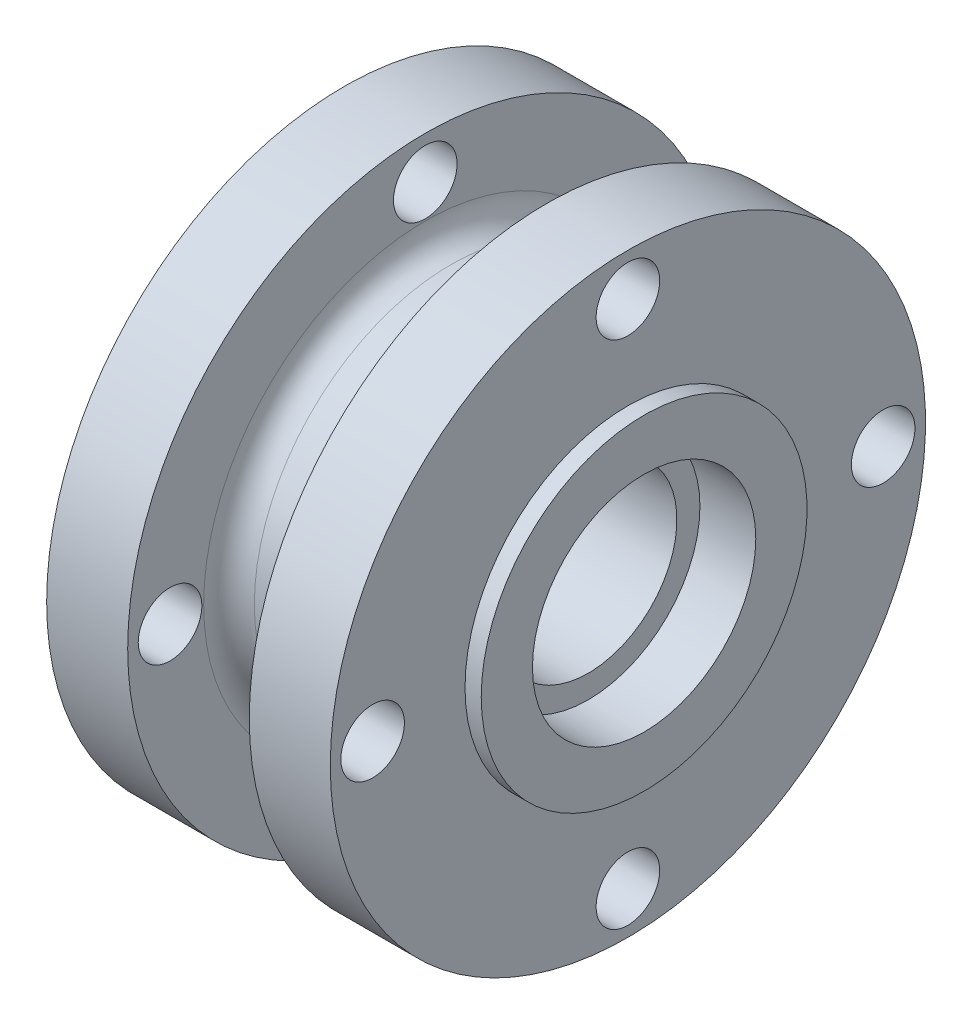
ISO-10303-21;
HEADER;
FILE_DESCRIPTION(('STEP AP214'),'2;1');
FILE_NAME('part.step','',(''),(''),'','','');
FILE_SCHEMA(('AUTOMOTIVE_DESIGN { 1 0 10303 214 1 1 1 1 }'));
ENDSEC;
DATA;
#1=APPLICATION_CONTEXT('core data for automotive mechanical design processes');
#2=APPLICATION_PROTOCOL_DEFINITION('international standard','automotive_design',2000,#1);
#3=PRODUCT_CONTEXT('',#1,'mechanical');
#4=PRODUCT('Part','Part','',(#3));
#5=PRODUCT_RELATED_PRODUCT_CATEGORY('part','',(#4));
#6=PRODUCT_DEFINITION_FORMATION('','',#4);
#7=PRODUCT_DEFINITION_CONTEXT('part definition',#1,'design');
#8=PRODUCT_DEFINITION('design','',#6,#7);
#9=PRODUCT_DEFINITION_SHAPE('','',#8);
#10=(LENGTH_UNIT() NAMED_UNIT(*) SI_UNIT(.MILLI.,.METRE.));
#11=(NAMED_UNIT(*) PLANE_ANGLE_UNIT() SI_UNIT($,.RADIAN.));
#12=(NAMED_UNIT(*) SI_UNIT($,.STERADIAN.) SOLID_ANGLE_UNIT());
#13=UNCERTAINTY_MEASURE_WITH_UNIT(LENGTH_MEASURE(1.E-05),#10,'distance_accuracy_value','');
#14=(GEOMETRIC_REPRESENTATION_CONTEXT(3) GLOBAL_UNCERTAINTY_ASSIGNED_CONTEXT((#13)) GLOBAL_UNIT_ASSIGNED_CONTEXT((#10,
#11,#12)) REPRESENTATION_CONTEXT('',''));
#15=CARTESIAN_POINT('',(0.,0.,0.));
#16=DIRECTION('',(0.,0.,1.));
#17=DIRECTION('',(1.,0.,0.));
#18=AXIS2_PLACEMENT_3D('',#15,#16,#17);
#19=CARTESIAN_POINT('',(12.192,24.6126,0.));
#20=DIRECTION('',(-1.,0.,0.));
#21=DIRECTION('',(0.,0.,1.));
#22=AXIS2_PLACEMENT_3D('',#19,#20,#21);
#23=PLANE('',#22);
#24=CARTESIAN_POINT('',(12.192,0.,0.));
#25=DIRECTION('',(-1.,0.,0.));
#26=DIRECTION('',(0.,0.,1.));
#27=AXIS2_PLACEMENT_3D('',#24,#25,#26);
#28=CIRCLE('',#27,27.7876);
#29=CARTESIAN_POINT('',(12.192,0.,27.7876));
#30=VERTEX_POINT('',#29);
#31=EDGE_CURVE('E10',#30,#30,#28,.T.);
#32=ORIENTED_EDGE('',*,*,#31,.T.);
#33=EDGE_LOOP('',(#32));
#34=FACE_BOUND('',#33,.T.);
#35=CARTESIAN_POINT('',(12.192,0.,32.004));
#36=DIRECTION('',(-1.,0.,0.));
#37=DIRECTION('',(0.,0.,1.));
#38=AXIS2_PLACEMENT_3D('',#35,#36,#37);
#39=CIRCLE('',#38,3.9878);
#40=CARTESIAN_POINT('',(12.192,0.,35.9918));
#41=VERTEX_POINT('',#40);
#42=EDGE_CURVE('E61',#41,#41,#39,.F.);
#43=ORIENTED_EDGE('',*,*,#42,.F.);
#44=EDGE_LOOP('',(#43));
#45=FACE_BOUND('',#44,.T.);
#46=CARTESIAN_POINT('',(12.192,-32.004,0.));
#47=DIRECTION('',(-1.,0.,0.));
#48=DIRECTION('',(0.,0.,1.));
#49=AXIS2_PLACEMENT_3D('',#46,#47,#48);
#50=CIRCLE('',#49,3.9878);
#51=CARTESIAN_POINT('',(12.192,-32.004,3.9878));
#52=VERTEX_POINT('',#51);
#53=EDGE_CURVE('E69',#52,#52,#50,.F.);
#54=ORIENTED_EDGE('',*,*,#53,.F.);
#55=EDGE_LOOP('',(#54));
#56=FACE_BOUND('',#55,.T.);
#57=CARTESIAN_POINT('',(12.192,0.,0.));
#58=DIRECTION('',(-1.,0.,0.));
#59=DIRECTION('',(0.,0.,1.));
#60=AXIS2_PLACEMENT_3D('',#57,#58,#59);
#61=CIRCLE('',#60,37.3126);
#62=CARTESIAN_POINT('',(12.192,0.,37.3126));
#63=VERTEX_POINT('',#62);
#64=EDGE_CURVE('E109',#63,#63,#61,.T.);
#65=ORIENTED_EDGE('',*,*,#64,.F.);
#66=EDGE_LOOP('',(#65));
#67=FACE_BOUND('',#66,.T.);
#68=CARTESIAN_POINT('',(12.192,32.004,0.));
#69=DIRECTION('',(-1.,0.,0.));
#70=DIRECTION('',(0.,0.,1.));
#71=AXIS2_PLACEMENT_3D('',#68,#69,#70);
#72=CIRCLE('',#71,3.9878);
#73=CARTESIAN_POINT('',(12.192,32.004,3.9878));
#74=VERTEX_POINT('',#73);
#75=EDGE_CURVE('E65',#74,#74,#72,.F.);
#76=ORIENTED_EDGE('',*,*,#75,.F.);
#77=EDGE_LOOP('',(#76));
#78=FACE_BOUND('',#77,.T.);
#79=CARTESIAN_POINT('',(12.192,0.,-32.004));
#80=DIRECTION('',(-1.,0.,0.));
#81=DIRECTION('',(0.,0.,1.));
#82=AXIS2_PLACEMENT_3D('',#79,#80,#81);
#83=CIRCLE('',#82,3.9878);
#84=CARTESIAN_POINT('',(12.192,0.,-28.0162));
#85=VERTEX_POINT('',#84);
#86=EDGE_CURVE('E57',#85,#85,#83,.F.);
#87=ORIENTED_EDGE('',*,*,#86,.F.);
#88=EDGE_LOOP('',(#87));
#89=FACE_BOUND('',#88,.T.);
#90=ADVANCED_FACE('F33',(#34,#45,#56,#67,#78,#89),#23,.F.);
#91=CARTESIAN_POINT('',(2.03199999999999,37.3126,0.));
#92=DIRECTION('',(1.,0.,0.));
#93=DIRECTION('',(0.,0.,-1.));
#94=AXIS2_PLACEMENT_3D('',#91,#92,#93);
#95=PLANE('',#94);
#96=CARTESIAN_POINT('',(2.032,0.,32.004));
#97=DIRECTION('',(1.,0.,0.));
#98=DIRECTION('',(0.,0.,-1.));
#99=AXIS2_PLACEMENT_3D('',#96,#97,#98);
#100=CIRCLE('',#99,3.9878);
#101=CARTESIAN_POINT('',(2.032,0.,28.0162));
#102=VERTEX_POINT('',#101);
#103=EDGE_CURVE('E58',#102,#102,#100,.F.);
#104=ORIENTED_EDGE('',*,*,#103,.F.);
#105=EDGE_LOOP('',(#104));
#106=FACE_BOUND('',#105,.T.);
#107=CARTESIAN_POINT('',(2.032,-32.004,0.));
#108=DIRECTION('',(1.,0.,0.));
#109=DIRECTION('',(0.,0.,-1.));
#110=AXIS2_PLACEMENT_3D('',#107,#108,#109);
#111=CIRCLE('',#110,3.9878);
#112=CARTESIAN_POINT('',(2.032,-32.004,-3.9878));
#113=VERTEX_POINT('',#112);
#114=EDGE_CURVE('E66',#113,#113,#111,.F.);
#115=ORIENTED_EDGE('',*,*,#114,.F.);
#116=EDGE_LOOP('',(#115));
#117=FACE_BOUND('',#116,.T.);
#118=CARTESIAN_POINT('',(2.03199999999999,0.,0.));
#119=DIRECTION('',(-1.,0.,0.));
#120=DIRECTION('',(0.,0.,1.));
#121=AXIS2_PLACEMENT_3D('',#118,#119,#120);
#122=CIRCLE('',#121,20.4216);
#123=CARTESIAN_POINT('',(2.03199999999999,0.,20.4216));
#124=VERTEX_POINT('',#123);
#125=EDGE_CURVE('E115',#124,#124,#122,.T.);
#126=ORIENTED_EDGE('',*,*,#125,.F.);
#127=EDGE_LOOP('',(#126));
#128=FACE_BOUND('',#127,.T.);
#129=CARTESIAN_POINT('',(2.03199999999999,0.,0.));
#130=DIRECTION('',(-1.,0.,0.));
#131=DIRECTION('',(0.,0.,1.));
#132=AXIS2_PLACEMENT_3D('',#129,#130,#131);
#133=CIRCLE('',#132,37.3126);
#134=CARTESIAN_POINT('',(2.03199999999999,0.,37.3126));
#135=VERTEX_POINT('',#134);
#136=EDGE_CURVE('E112',#135,#135,#133,.T.);
#137=ORIENTED_EDGE('',*,*,#136,.T.);
#138=EDGE_LOOP('',(#137));
#139=FACE_BOUND('',#138,.T.);
#140=CARTESIAN_POINT('',(2.032,32.004,0.));
#141=DIRECTION('',(1.,0.,0.));
#142=DIRECTION('',(0.,0.,-1.));
#143=AXIS2_PLACEMENT_3D('',#140,#141,#142);
#144=CIRCLE('',#143,3.9878);
#145=CARTESIAN_POINT('',(2.032,32.004,-3.9878));
#146=VERTEX_POINT('',#145);
#147=EDGE_CURVE('E62',#146,#146,#144,.F.);
#148=ORIENTED_EDGE('',*,*,#147,.F.);
#149=EDGE_LOOP('',(#148));
#150=FACE_BOUND('',#149,.T.);
#151=CARTESIAN_POINT('',(2.032,0.,-32.004));
#152=DIRECTION('',(1.,0.,0.));
#153=DIRECTION('',(0.,0.,-1.));
#154=AXIS2_PLACEMENT_3D('',#151,#152,#153);
#155=CIRCLE('',#154,3.9878);
#156=CARTESIAN_POINT('',(2.032,0.,-35.9918));
#157=VERTEX_POINT('',#156);
#158=EDGE_CURVE('E54',#157,#157,#155,.F.);
#159=ORIENTED_EDGE('',*,*,#158,.F.);
#160=EDGE_LOOP('',(#159));
#161=FACE_BOUND('',#160,.T.);
#162=ADVANCED_FACE('F147',(#106,#117,#128,#139,#150,#161),#95,.F.);
#163=CARTESIAN_POINT('',(37.592,20.4216,0.));
#164=DIRECTION('',(-1.,0.,0.));
#165=DIRECTION('',(0.,0.,1.));
#166=AXIS2_PLACEMENT_3D('',#163,#164,#165);
#167=PLANE('',#166);
#168=CARTESIAN_POINT('',(37.592,0.,32.004));
#169=DIRECTION('',(-1.,0.,0.));
#170=DIRECTION('',(0.,0.,1.));
#171=AXIS2_PLACEMENT_3D('',#168,#169,#170);
#172=CIRCLE('',#171,3.9878);
#173=CARTESIAN_POINT('',(37.592,0.,35.9918));
#174=VERTEX_POINT('',#173);
#175=EDGE_CURVE('E77',#174,#174,#172,.F.);
#176=ORIENTED_EDGE('',*,*,#175,.F.);
#177=EDGE_LOOP('',(#176));
#178=FACE_BOUND('',#177,.T.);
#179=CARTESIAN_POINT('',(37.592,32.004,0.));
#180=DIRECTION('',(-1.,0.,0.));
#181=DIRECTION('',(0.,0.,1.));
#182=AXIS2_PLACEMENT_3D('',#179,#180,#181);
#183=CIRCLE('',#182,3.9878);
#184=CARTESIAN_POINT('',(37.592,32.004,3.9878));
#185=VERTEX_POINT('',#184);
#186=EDGE_CURVE('E85',#185,#185,#183,.F.);
#187=ORIENTED_EDGE('',*,*,#186,.F.);
#188=EDGE_LOOP('',(#187));
#189=FACE_BOUND('',#188,.T.);
#190=CARTESIAN_POINT('',(37.592,0.,0.));
#191=DIRECTION('',(-1.,0.,0.));
#192=DIRECTION('',(0.,0.,1.));
#193=AXIS2_PLACEMENT_3D('',#190,#191,#192);
#194=CIRCLE('',#193,37.3126);
#195=CARTESIAN_POINT('',(37.592,0.,37.3126));
#196=VERTEX_POINT('',#195);
#197=EDGE_CURVE('E103',#196,#196,#194,.T.);
#198=ORIENTED_EDGE('',*,*,#197,.F.);
#199=EDGE_LOOP('',(#198));
#200=FACE_BOUND('',#199,.T.);
#201=CARTESIAN_POINT('',(37.592,0.,0.));
#202=DIRECTION('',(-1.,0.,0.));
#203=DIRECTION('',(0.,0.,1.));
#204=AXIS2_PLACEMENT_3D('',#201,#202,#203);
#205=CIRCLE('',#204,20.4216);
#206=CARTESIAN_POINT('',(37.592,0.,20.4216));
#207=VERTEX_POINT('',#206);
#208=EDGE_CURVE('E100',#207,#207,#205,.T.);
#209=ORIENTED_EDGE('',*,*,#208,.T.);
#210=EDGE_LOOP('',(#209));
#211=FACE_BOUND('',#210,.T.);
#212=CARTESIAN_POINT('',(37.592,0.,-32.004));
#213=DIRECTION('',(-1.,0.,0.));
#214=DIRECTION('',(0.,0.,1.));
#215=AXIS2_PLACEMENT_3D('',#212,#213,#214);
#216=CIRCLE('',#215,3.9878);
#217=CARTESIAN_POINT('',(37.592,0.,-28.0162));
#218=VERTEX_POINT('',#217);
#219=EDGE_CURVE('E81',#218,#218,#216,.F.);
#220=ORIENTED_EDGE('',*,*,#219,.F.);
#221=EDGE_LOOP('',(#220));
#222=FACE_BOUND('',#221,.T.);
#223=CARTESIAN_POINT('',(37.592,-32.004,0.));
#224=DIRECTION('',(-1.,0.,0.));
#225=DIRECTION('',(0.,0.,1.));
#226=AXIS2_PLACEMENT_3D('',#223,#224,#225);
#227=CIRCLE('',#226,3.9878);
#228=CARTESIAN_POINT('',(37.592,-32.004,3.9878));
#229=VERTEX_POINT('',#228);
#230=EDGE_CURVE('E73',#229,#229,#227,.F.);
#231=ORIENTED_EDGE('',*,*,#230,.F.);
#232=EDGE_LOOP('',(#231));
#233=FACE_BOUND('',#232,.T.);
#234=ADVANCED_FACE('F152',(#178,#189,#200,#211,#222,#233),#167,.F.);
#235=CARTESIAN_POINT('',(27.432,24.6126,0.));
#236=DIRECTION('',(1.,0.,0.));
#237=DIRECTION('',(0.,0.,-1.));
#238=AXIS2_PLACEMENT_3D('',#235,#236,#237);
#239=PLANE('',#238);
#240=CARTESIAN_POINT('',(27.432,0.,0.));
#241=DIRECTION('',(1.,0.,0.));
#242=DIRECTION('',(0.,0.,-1.));
#243=AXIS2_PLACEMENT_3D('',#240,#241,#242);
#244=CIRCLE('',#243,27.7876);
#245=CARTESIAN_POINT('',(27.432,0.,-27.7876));
#246=VERTEX_POINT('',#245);
#247=EDGE_CURVE('E40',#246,#246,#244,.T.);
#248=ORIENTED_EDGE('',*,*,#247,.T.);
#249=EDGE_LOOP('',(#248));
#250=FACE_BOUND('',#249,.T.);
#251=CARTESIAN_POINT('',(27.432,0.,32.004));
#252=DIRECTION('',(1.,0.,0.));
#253=DIRECTION('',(0.,0.,-1.));
#254=AXIS2_PLACEMENT_3D('',#251,#252,#253);
#255=CIRCLE('',#254,3.9878);
#256=CARTESIAN_POINT('',(27.432,0.,35.9918));
#257=VERTEX_POINT('',#256);
#258=EDGE_CURVE('E74',#257,#257,#255,.F.);
#259=ORIENTED_EDGE('',*,*,#258,.F.);
#260=EDGE_LOOP('',(#259));
#261=FACE_BOUND('',#260,.T.);
#262=CARTESIAN_POINT('',(27.432,32.004,0.));
#263=DIRECTION('',(1.,0.,0.));
#264=DIRECTION('',(0.,0.,-1.));
#265=AXIS2_PLACEMENT_3D('',#262,#263,#264);
#266=CIRCLE('',#265,3.9878);
#267=CARTESIAN_POINT('',(27.432,32.004,3.9878));
#268=VERTEX_POINT('',#267);
#269=EDGE_CURVE('E82',#268,#268,#266,.F.);
#270=ORIENTED_EDGE('',*,*,#269,.F.);
#271=EDGE_LOOP('',(#270));
#272=FACE_BOUND('',#271,.T.);
#273=CARTESIAN_POINT('',(27.432,0.,0.));
#274=DIRECTION('',(-1.,0.,0.));
#275=DIRECTION('',(0.,0.,1.));
#276=AXIS2_PLACEMENT_3D('',#273,#274,#275);
#277=CIRCLE('',#276,37.3126);
#278=CARTESIAN_POINT('',(27.432,0.,37.3126));
#279=VERTEX_POINT('',#278);
#280=EDGE_CURVE('E106',#279,#279,#277,.T.);
#281=ORIENTED_EDGE('',*,*,#280,.T.);
#282=EDGE_LOOP('',(#281));
#283=FACE_BOUND('',#282,.T.);
#284=CARTESIAN_POINT('',(27.432,0.,-32.004));
#285=DIRECTION('',(1.,0.,0.));
#286=DIRECTION('',(0.,0.,-1.));
#287=AXIS2_PLACEMENT_3D('',#284,#285,#286);
#288=CIRCLE('',#287,3.9878);
#289=CARTESIAN_POINT('',(27.432,0.,-28.0162));
#290=VERTEX_POINT('',#289);
#291=EDGE_CURVE('E78',#290,#290,#288,.F.);
#292=ORIENTED_EDGE('',*,*,#291,.F.);
#293=EDGE_LOOP('',(#292));
#294=FACE_BOUND('',#293,.T.);
#295=CARTESIAN_POINT('',(27.432,-32.004,0.));
#296=DIRECTION('',(1.,0.,0.));
#297=DIRECTION('',(0.,0.,-1.));
#298=AXIS2_PLACEMENT_3D('',#295,#296,#297);
#299=CIRCLE('',#298,3.9878);
#300=CARTESIAN_POINT('',(27.432,-32.004,3.9878));
#301=VERTEX_POINT('',#300);
#302=EDGE_CURVE('E70',#301,#301,#299,.F.);
#303=ORIENTED_EDGE('',*,*,#302,.F.);
#304=EDGE_LOOP('',(#303));
#305=FACE_BOUND('',#304,.T.);
#306=ADVANCED_FACE('F164',(#250,#261,#272,#283,#294,#305),#239,.F.);
#307=CARTESIAN_POINT('',(7.,14.,0.));
#308=DIRECTION('',(1.,0.,0.));
#309=DIRECTION('',(0.,0.,-1.));
#310=AXIS2_PLACEMENT_3D('',#307,#308,#309);
#311=PLANE('',#310);
#312=CARTESIAN_POINT('',(7.,0.,0.));
#313=DIRECTION('',(-1.,0.,0.));
#314=DIRECTION('',(0.,0.,1.));
#315=AXIS2_PLACEMENT_3D('',#312,#313,#314);
#316=CIRCLE('',#315,11.1125);
#317=CARTESIAN_POINT('',(7.,0.,11.1125));
#318=VERTEX_POINT('',#317);
#319=EDGE_CURVE('E53',#318,#318,#316,.T.);
#320=ORIENTED_EDGE('',*,*,#319,.F.);
#321=EDGE_LOOP('',(#320));
#322=FACE_BOUND('',#321,.T.);
#323=CARTESIAN_POINT('',(7.,0.,0.));
#324=DIRECTION('',(-1.,0.,0.));
#325=DIRECTION('',(0.,0.,1.));
#326=AXIS2_PLACEMENT_3D('',#323,#324,#325);
#327=CIRCLE('',#326,14.);
#328=CARTESIAN_POINT('',(7.,0.,14.));
#329=VERTEX_POINT('',#328);
#330=EDGE_CURVE('E124',#329,#329,#327,.T.);
#331=ORIENTED_EDGE('',*,*,#330,.T.);
#332=EDGE_LOOP('',(#331));
#333=FACE_BOUND('',#332,.T.);
#334=ADVANCED_FACE('F167',(#322,#333),#311,.F.);
#335=CARTESIAN_POINT('',(0.,0.,0.));
#336=DIRECTION('',(-1.,0.,0.));
#337=DIRECTION('',(0.,0.,1.));
#338=AXIS2_PLACEMENT_3D('',#335,#336,#337);
#339=CYLINDRICAL_SURFACE('',#338,11.1125);
#340=CARTESIAN_POINT('',(32.624,0.,0.));
#341=DIRECTION('',(-1.,0.,0.));
#342=DIRECTION('',(0.,0.,1.));
#343=AXIS2_PLACEMENT_3D('',#340,#341,#342);
#344=CIRCLE('',#343,11.1125);
#345=CARTESIAN_POINT('',(32.624,0.,11.1125));
#346=VERTEX_POINT('',#345);
#347=EDGE_CURVE('E88',#346,#346,#344,.T.);
#348=ORIENTED_EDGE('',*,*,#347,.F.);
#349=EDGE_LOOP('',(#348));
#350=FACE_BOUND('',#349,.T.);
#351=ORIENTED_EDGE('',*,*,#319,.T.);
#352=EDGE_LOOP('',(#351));
#353=FACE_BOUND('',#352,.T.);
#354=ADVANCED_FACE('F189',(#350,#353),#339,.F.);
#355=CARTESIAN_POINT('',(32.624,11.1125,0.));
#356=DIRECTION('',(-1.,0.,0.));
#357=DIRECTION('',(0.,0.,1.));
#358=AXIS2_PLACEMENT_3D('',#355,#356,#357);
#359=PLANE('',#358);
#360=CARTESIAN_POINT('',(32.624,0.,0.));
#361=DIRECTION('',(-1.,0.,0.));
#362=DIRECTION('',(0.,0.,1.));
#363=AXIS2_PLACEMENT_3D('',#360,#361,#362);
#364=CIRCLE('',#363,14.);
#365=CARTESIAN_POINT('',(32.624,0.,14.));
#366=VERTEX_POINT('',#365);
#367=EDGE_CURVE('E91',#366,#366,#364,.T.);
#368=ORIENTED_EDGE('',*,*,#367,.F.);
#369=EDGE_LOOP('',(#368));
#370=FACE_BOUND('',#369,.T.);
#371=ORIENTED_EDGE('',*,*,#347,.T.);
#372=EDGE_LOOP('',(#371));
#373=FACE_BOUND('',#372,.T.);
#374=ADVANCED_FACE('F185',(#370,#373),#359,.F.);
#375=CARTESIAN_POINT('',(0.,0.,0.));
#376=DIRECTION('',(-1.,0.,0.));
#377=DIRECTION('',(0.,0.,1.));
#378=AXIS2_PLACEMENT_3D('',#375,#376,#377);
#379=CYLINDRICAL_SURFACE('',#378,14.);
#380=CARTESIAN_POINT('',(39.624,0.,0.));
#381=DIRECTION('',(-1.,0.,0.));
#382=DIRECTION('',(0.,0.,1.));
#383=AXIS2_PLACEMENT_3D('',#380,#381,#382);
#384=CIRCLE('',#383,14.);
#385=CARTESIAN_POINT('',(39.624,0.,14.));
#386=VERTEX_POINT('',#385);
#387=EDGE_CURVE('E94',#386,#386,#384,.T.);
#388=ORIENTED_EDGE('',*,*,#387,.F.);
#389=EDGE_LOOP('',(#388));
#390=FACE_BOUND('',#389,.T.);
#391=ORIENTED_EDGE('',*,*,#367,.T.);
#392=EDGE_LOOP('',(#391));
#393=FACE_BOUND('',#392,.T.);
#394=ADVANCED_FACE('F181',(#390,#393),#379,.F.);
#395=CARTESIAN_POINT('',(39.624,14.,0.));
#396=DIRECTION('',(-1.,0.,0.));
#397=DIRECTION('',(0.,0.,1.));
#398=AXIS2_PLACEMENT_3D('',#395,#396,#397);
#399=PLANE('',#398);
#400=CARTESIAN_POINT('',(39.624,0.,0.));
#401=DIRECTION('',(-1.,0.,0.));
#402=DIRECTION('',(0.,0.,1.));
#403=AXIS2_PLACEMENT_3D('',#400,#401,#402);
#404=CIRCLE('',#403,20.4216);
#405=CARTESIAN_POINT('',(39.624,0.,20.4216));
#406=VERTEX_POINT('',#405);
#407=EDGE_CURVE('E97',#406,#406,#404,.T.);
#408=ORIENTED_EDGE('',*,*,#407,.F.);
#409=EDGE_LOOP('',(#408));
#410=FACE_BOUND('',#409,.T.);
#411=ORIENTED_EDGE('',*,*,#387,.T.);
#412=EDGE_LOOP('',(#411));
#413=FACE_BOUND('',#412,.T.);
#414=ADVANCED_FACE('F177',(#410,#413),#399,.F.);
#415=CARTESIAN_POINT('',(0.,0.,0.));
#416=DIRECTION('',(-1.,0.,0.));
#417=DIRECTION('',(0.,0.,1.));
#418=AXIS2_PLACEMENT_3D('',#415,#416,#417);
#419=CYLINDRICAL_SURFACE('',#418,20.4216);
#420=ORIENTED_EDGE('',*,*,#208,.F.);
#421=EDGE_LOOP('',(#420));
#422=FACE_BOUND('',#421,.T.);
#423=ORIENTED_EDGE('',*,*,#407,.T.);
#424=EDGE_LOOP('',(#423));
#425=FACE_BOUND('',#424,.T.);
#426=ADVANCED_FACE('F170',(#422,#425),#419,.T.);
#427=CARTESIAN_POINT('',(0.,0.,0.));
#428=DIRECTION('',(-1.,0.,0.));
#429=DIRECTION('',(0.,0.,1.));
#430=AXIS2_PLACEMENT_3D('',#427,#428,#429);
#431=CYLINDRICAL_SURFACE('',#430,37.3126);
#432=ORIENTED_EDGE('',*,*,#280,.F.);
#433=EDGE_LOOP('',(#432));
#434=FACE_BOUND('',#433,.T.);
#435=ORIENTED_EDGE('',*,*,#197,.T.);
#436=EDGE_LOOP('',(#435));
#437=FACE_BOUND('',#436,.T.);
#438=ADVANCED_FACE('F162',(#434,#437),#431,.T.);
#439=CARTESIAN_POINT('',(0.,0.,0.));
#440=DIRECTION('',(-1.,0.,0.));
#441=DIRECTION('',(0.,0.,1.));
#442=AXIS2_PLACEMENT_3D('',#439,#440,#441);
#443=CYLINDRICAL_SURFACE('',#442,24.6126);
#444=CARTESIAN_POINT('',(24.257,0.,0.));
#445=DIRECTION('',(1.,0.,0.));
#446=DIRECTION('',(0.,0.,-1.));
#447=AXIS2_PLACEMENT_3D('',#444,#445,#446);
#448=CIRCLE('',#447,24.6126);
#449=CARTESIAN_POINT('',(24.257,0.,-24.6126));
#450=VERTEX_POINT('',#449);
#451=EDGE_CURVE('E44',#450,#450,#448,.F.);
#452=ORIENTED_EDGE('',*,*,#451,.T.);
#453=EDGE_LOOP('',(#452));
#454=FACE_BOUND('',#453,.T.);
#455=CARTESIAN_POINT('',(15.367,0.,0.));
#456=DIRECTION('',(-1.,0.,0.));
#457=DIRECTION('',(0.,0.,1.));
#458=AXIS2_PLACEMENT_3D('',#455,#456,#457);
#459=CIRCLE('',#458,24.6126);
#460=CARTESIAN_POINT('',(15.367,0.,24.6126));
#461=VERTEX_POINT('',#460);
#462=EDGE_CURVE('E48',#461,#461,#459,.F.);
#463=ORIENTED_EDGE('',*,*,#462,.T.);
#464=EDGE_LOOP('',(#463));
#465=FACE_BOUND('',#464,.T.);
#466=ADVANCED_FACE('F159',(#454,#465),#443,.T.);
#467=CARTESIAN_POINT('',(0.,0.,0.));
#468=DIRECTION('',(-1.,0.,0.));
#469=DIRECTION('',(0.,0.,1.));
#470=AXIS2_PLACEMENT_3D('',#467,#468,#469);
#471=CYLINDRICAL_SURFACE('',#470,37.3126);
#472=ORIENTED_EDGE('',*,*,#136,.F.);
#473=EDGE_LOOP('',(#472));
#474=FACE_BOUND('',#473,.T.);
#475=ORIENTED_EDGE('',*,*,#64,.T.);
#476=EDGE_LOOP('',(#475));
#477=FACE_BOUND('',#476,.T.);
#478=ADVANCED_FACE('F158',(#474,#477),#471,.T.);
#479=CARTESIAN_POINT('',(0.,0.,0.));
#480=DIRECTION('',(-1.,0.,0.));
#481=DIRECTION('',(0.,0.,1.));
#482=AXIS2_PLACEMENT_3D('',#479,#480,#481);
#483=CYLINDRICAL_SURFACE('',#482,20.4216);
#484=CARTESIAN_POINT('',(0.,0.,0.));
#485=DIRECTION('',(-1.,0.,0.));
#486=DIRECTION('',(0.,0.,1.));
#487=AXIS2_PLACEMENT_3D('',#484,#485,#486);
#488=CIRCLE('',#487,20.4216);
#489=CARTESIAN_POINT('',(0.,0.,20.4216));
#490=VERTEX_POINT('',#489);
#491=EDGE_CURVE('E118',#490,#490,#488,.T.);
#492=ORIENTED_EDGE('',*,*,#491,.F.);
#493=EDGE_LOOP('',(#492));
#494=FACE_BOUND('',#493,.T.);
#495=ORIENTED_EDGE('',*,*,#125,.T.);
#496=EDGE_LOOP('',(#495));
#497=FACE_BOUND('',#496,.T.);
#498=ADVANCED_FACE('F249',(#494,#497),#483,.T.);
#499=CARTESIAN_POINT('',(0.,20.4216,0.));
#500=DIRECTION('',(1.,0.,0.));
#501=DIRECTION('',(0.,0.,-1.));
#502=AXIS2_PLACEMENT_3D('',#499,#500,#501);
#503=PLANE('',#502);
#504=CARTESIAN_POINT('',(0.,0.,0.));
#505=DIRECTION('',(-1.,0.,0.));
#506=DIRECTION('',(0.,0.,1.));
#507=AXIS2_PLACEMENT_3D('',#504,#505,#506);
#508=CIRCLE('',#507,14.);
#509=CARTESIAN_POINT('',(0.,0.,14.));
#510=VERTEX_POINT('',#509);
#511=EDGE_CURVE('E121',#510,#510,#508,.T.);
#512=ORIENTED_EDGE('',*,*,#511,.F.);
#513=EDGE_LOOP('',(#512));
#514=FACE_BOUND('',#513,.T.);
#515=ORIENTED_EDGE('',*,*,#491,.T.);
#516=EDGE_LOOP('',(#515));
#517=FACE_BOUND('',#516,.T.);
#518=ADVANCED_FACE('F245',(#514,#517),#503,.F.);
#519=CARTESIAN_POINT('',(0.,0.,0.));
#520=DIRECTION('',(-1.,0.,0.));
#521=DIRECTION('',(0.,0.,1.));
#522=AXIS2_PLACEMENT_3D('',#519,#520,#521);
#523=CYLINDRICAL_SURFACE('',#522,14.);
#524=ORIENTED_EDGE('',*,*,#330,.F.);
#525=EDGE_LOOP('',(#524));
#526=FACE_BOUND('',#525,.T.);
#527=ORIENTED_EDGE('',*,*,#511,.T.);
#528=EDGE_LOOP('',(#527));
#529=FACE_BOUND('',#528,.T.);
#530=ADVANCED_FACE('F241',(#526,#529),#523,.F.);
#531=CARTESIAN_POINT('',(43.18,32.004,0.));
#532=DIRECTION('',(-1.,0.,0.));
#533=DIRECTION('',(0.,0.,1.));
#534=AXIS2_PLACEMENT_3D('',#531,#532,#533);
#535=CYLINDRICAL_SURFACE('',#534,3.9878);
#536=CARTESIAN_POINT('',(27.432,32.004,3.9878));
#537=CARTESIAN_POINT('',(27.5378333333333,32.004,3.9878));
#538=CARTESIAN_POINT('',(27.6436666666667,32.004,3.9878));
#539=CARTESIAN_POINT('',(27.8553333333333,32.004,3.9878));
#540=CARTESIAN_POINT('',(27.9611666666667,32.004,3.9878));
#541=CARTESIAN_POINT('',(28.1728333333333,32.004,3.9878));
#542=CARTESIAN_POINT('',(28.2786666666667,32.004,3.9878));
#543=CARTESIAN_POINT('',(28.4903333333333,32.004,3.9878));
#544=CARTESIAN_POINT('',(28.5961666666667,32.004,3.9878));
#545=CARTESIAN_POINT('',(28.8078333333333,32.004,3.9878));
#546=CARTESIAN_POINT('',(28.9136666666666,32.004,3.9878));
#547=CARTESIAN_POINT('',(29.1253333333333,32.004,3.9878));
#548=CARTESIAN_POINT('',(29.2311666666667,32.004,3.9878));
#549=CARTESIAN_POINT('',(29.4428333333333,32.004,3.9878));
#550=CARTESIAN_POINT('',(29.5486666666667,32.004,3.9878));
#551=CARTESIAN_POINT('',(29.7603333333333,32.004,3.9878));
#552=CARTESIAN_POINT('',(29.8661666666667,32.004,3.9878));
#553=CARTESIAN_POINT('',(30.0778333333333,32.004,3.9878));
#554=CARTESIAN_POINT('',(30.1836666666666,32.004,3.9878));
#555=CARTESIAN_POINT('',(30.3953333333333,32.004,3.9878));
#556=CARTESIAN_POINT('',(30.5011666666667,32.004,3.9878));
#557=CARTESIAN_POINT('',(30.7128333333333,32.004,3.9878));
#558=CARTESIAN_POINT('',(30.8186666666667,32.004,3.9878));
#559=CARTESIAN_POINT('',(31.0303333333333,32.004,3.9878));
#560=CARTESIAN_POINT('',(31.1361666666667,32.004,3.9878));
#561=CARTESIAN_POINT('',(31.3478333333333,32.004,3.9878));
#562=CARTESIAN_POINT('',(31.4536666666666,32.004,3.9878));
#563=CARTESIAN_POINT('',(31.6653333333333,32.004,3.9878));
#564=CARTESIAN_POINT('',(31.7711666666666,32.004,3.9878));
#565=CARTESIAN_POINT('',(31.9828333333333,32.004,3.9878));
#566=CARTESIAN_POINT('',(32.0886666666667,32.004,3.9878));
#567=CARTESIAN_POINT('',(32.3003333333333,32.004,3.9878));
#568=CARTESIAN_POINT('',(32.4061666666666,32.004,3.9878));
#569=CARTESIAN_POINT('',(32.6178333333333,32.004,3.9878));
#570=CARTESIAN_POINT('',(32.7236666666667,32.004,3.9878));
#571=CARTESIAN_POINT('',(32.9353333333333,32.004,3.9878));
#572=CARTESIAN_POINT('',(33.0411666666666,32.004,3.9878));
#573=CARTESIAN_POINT('',(33.2528333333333,32.004,3.9878));
#574=CARTESIAN_POINT('',(33.3586666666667,32.004,3.9878));
#575=CARTESIAN_POINT('',(33.5703333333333,32.004,3.9878));
#576=CARTESIAN_POINT('',(33.6761666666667,32.004,3.9878));
#577=CARTESIAN_POINT('',(33.8878333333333,32.004,3.9878));
#578=CARTESIAN_POINT('',(33.9936666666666,32.004,3.9878));
#579=CARTESIAN_POINT('',(34.2053333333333,32.004,3.9878));
#580=CARTESIAN_POINT('',(34.3111666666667,32.004,3.9878));
#581=CARTESIAN_POINT('',(34.5228333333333,32.004,3.9878));
#582=CARTESIAN_POINT('',(34.6286666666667,32.004,3.9878));
#583=CARTESIAN_POINT('',(34.8403333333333,32.004,3.9878));
#584=CARTESIAN_POINT('',(34.9461666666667,32.004,3.9878));
#585=CARTESIAN_POINT('',(35.1578333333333,32.004,3.9878));
#586=CARTESIAN_POINT('',(35.2636666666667,32.004,3.9878));
#587=CARTESIAN_POINT('',(35.4753333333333,32.004,3.9878));
#588=CARTESIAN_POINT('',(35.5811666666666,32.004,3.9878));
#589=CARTESIAN_POINT('',(35.7928333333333,32.004,3.9878));
#590=CARTESIAN_POINT('',(35.8986666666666,32.004,3.9878));
#591=CARTESIAN_POINT('',(36.1103333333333,32.004,3.9878));
#592=CARTESIAN_POINT('',(36.2161666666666,32.004,3.9878));
#593=CARTESIAN_POINT('',(36.4278333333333,32.004,3.9878));
#594=CARTESIAN_POINT('',(36.5336666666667,32.004,3.9878));
#595=CARTESIAN_POINT('',(36.7453333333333,32.004,3.9878));
#596=CARTESIAN_POINT('',(36.8511666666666,32.004,3.9878));
#597=CARTESIAN_POINT('',(37.0628333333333,32.004,3.9878));
#598=CARTESIAN_POINT('',(37.1686666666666,32.004,3.9878));
#599=CARTESIAN_POINT('',(37.3803333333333,32.004,3.9878));
#600=CARTESIAN_POINT('',(37.4861666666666,32.004,3.9878));
#601=CARTESIAN_POINT('',(37.592,32.004,3.9878));
#602=B_SPLINE_CURVE_WITH_KNOTS('',3,(#536,#537,#538,#539,#540,#541,#542,#543,#544,#545,#546,
#547,#548,#549,#550,#551,#552,#553,#554,#555,#556,#557,#558,#559,#560,#561,#562,#563,#564,#565,
#566,#567,#568,#569,#570,#571,#572,#573,#574,#575,#576,#577,#578,#579,#580,#581,#582,#583,#584,
#585,#586,#587,#588,#589,#590,#591,#592,#593,#594,#595,#596,#597,#598,#599,#600,#601),
.UNSPECIFIED.,.F.,.F.,(4,2,2,2,2,2,2,2,2,2,2,2,2,2,2,2,2,2,2,2,2,2,2,2,2,2,2,2,2,2,2,2,4),(0.,
0.317499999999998,0.635,0.952499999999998,1.27,1.5875,1.905,2.2225,2.54,2.8575,3.175,3.4925,
3.81,4.1275,4.44499999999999,4.7625,5.08,5.3975,5.71499999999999,6.03249999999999,6.35,6.6675,
6.98499999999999,7.3025,7.62,7.9375,8.255,8.57249999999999,8.88999999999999,9.2075,9.525,
9.84249999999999,10.16),.UNSPECIFIED.);
#603=EDGE_CURVE('BSEAM237',#268,#185,#602,.T.);
#604=ORIENTED_EDGE('',*,*,#269,.T.);
#605=ORIENTED_EDGE('',*,*,#186,.T.);
#606=ORIENTED_EDGE('',*,*,#603,.T.);
#607=ORIENTED_EDGE('',*,*,#603,.F.);
#608=EDGE_LOOP('',(#604,#606,#605,#607));
#609=FACE_BOUND('',#608,.T.);
#610=ADVANCED_FACE('F237',(#609),#535,.F.);
#611=CARTESIAN_POINT('',(43.18,0.,-32.004));
#612=DIRECTION('',(-1.,0.,0.));
#613=DIRECTION('',(0.,0.,1.));
#614=AXIS2_PLACEMENT_3D('',#611,#612,#613);
#615=CYLINDRICAL_SURFACE('',#614,3.9878);
#616=CARTESIAN_POINT('',(27.432,0.,-28.0162));
#617=CARTESIAN_POINT('',(27.5378333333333,0.,-28.0162));
#618=CARTESIAN_POINT('',(27.6436666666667,0.,-28.0162));
#619=CARTESIAN_POINT('',(27.8553333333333,0.,-28.0162));
#620=CARTESIAN_POINT('',(27.9611666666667,0.,-28.0162));
#621=CARTESIAN_POINT('',(28.1728333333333,0.,-28.0162));
#622=CARTESIAN_POINT('',(28.2786666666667,0.,-28.0162));
#623=CARTESIAN_POINT('',(28.4903333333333,0.,-28.0162));
#624=CARTESIAN_POINT('',(28.5961666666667,0.,-28.0162));
#625=CARTESIAN_POINT('',(28.8078333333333,0.,-28.0162));
#626=CARTESIAN_POINT('',(28.9136666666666,0.,-28.0162));
#627=CARTESIAN_POINT('',(29.1253333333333,0.,-28.0162));
#628=CARTESIAN_POINT('',(29.2311666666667,0.,-28.0162));
#629=CARTESIAN_POINT('',(29.4428333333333,0.,-28.0162));
#630=CARTESIAN_POINT('',(29.5486666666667,0.,-28.0162));
#631=CARTESIAN_POINT('',(29.7603333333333,0.,-28.0162));
#632=CARTESIAN_POINT('',(29.8661666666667,0.,-28.0162));
#633=CARTESIAN_POINT('',(30.0778333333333,0.,-28.0162));
#634=CARTESIAN_POINT('',(30.1836666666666,0.,-28.0162));
#635=CARTESIAN_POINT('',(30.3953333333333,0.,-28.0162));
#636=CARTESIAN_POINT('',(30.5011666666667,0.,-28.0162));
#637=CARTESIAN_POINT('',(30.7128333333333,0.,-28.0162));
#638=CARTESIAN_POINT('',(30.8186666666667,0.,-28.0162));
#639=CARTESIAN_POINT('',(31.0303333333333,0.,-28.0162));
#640=CARTESIAN_POINT('',(31.1361666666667,0.,-28.0162));
#641=CARTESIAN_POINT('',(31.3478333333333,0.,-28.0162));
#642=CARTESIAN_POINT('',(31.4536666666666,0.,-28.0162));
#643=CARTESIAN_POINT('',(31.6653333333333,0.,-28.0162));
#644=CARTESIAN_POINT('',(31.7711666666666,0.,-28.0162));
#645=CARTESIAN_POINT('',(31.9828333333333,0.,-28.0162));
#646=CARTESIAN_POINT('',(32.0886666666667,0.,-28.0162));
#647=CARTESIAN_POINT('',(32.3003333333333,0.,-28.0162));
#648=CARTESIAN_POINT('',(32.4061666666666,0.,-28.0162));
#649=CARTESIAN_POINT('',(32.6178333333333,0.,-28.0162));
#650=CARTESIAN_POINT('',(32.7236666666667,0.,-28.0162));
#651=CARTESIAN_POINT('',(32.9353333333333,0.,-28.0162));
#652=CARTESIAN_POINT('',(33.0411666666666,0.,-28.0162));
#653=CARTESIAN_POINT('',(33.2528333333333,0.,-28.0162));
#654=CARTESIAN_POINT('',(33.3586666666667,0.,-28.0162));
#655=CARTESIAN_POINT('',(33.5703333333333,0.,-28.0162));
#656=CARTESIAN_POINT('',(33.6761666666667,0.,-28.0162));
#657=CARTESIAN_POINT('',(33.8878333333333,0.,-28.0162));
#658=CARTESIAN_POINT('',(33.9936666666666,0.,-28.0162));
#659=CARTESIAN_POINT('',(34.2053333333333,0.,-28.0162));
#660=CARTESIAN_POINT('',(34.3111666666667,0.,-28.0162));
#661=CARTESIAN_POINT('',(34.5228333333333,0.,-28.0162));
#662=CARTESIAN_POINT('',(34.6286666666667,0.,-28.0162));
#663=CARTESIAN_POINT('',(34.8403333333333,0.,-28.0162));
#664=CARTESIAN_POINT('',(34.9461666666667,0.,-28.0162));
#665=CARTESIAN_POINT('',(35.1578333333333,0.,-28.0162));
#666=CARTESIAN_POINT('',(35.2636666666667,0.,-28.0162));
#667=CARTESIAN_POINT('',(35.4753333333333,0.,-28.0162));
#668=CARTESIAN_POINT('',(35.5811666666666,0.,-28.0162));
#669=CARTESIAN_POINT('',(35.7928333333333,0.,-28.0162));
#670=CARTESIAN_POINT('',(35.8986666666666,0.,-28.0162));
#671=CARTESIAN_POINT('',(36.1103333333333,0.,-28.0162));
#672=CARTESIAN_POINT('',(36.2161666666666,0.,-28.0162));
#673=CARTESIAN_POINT('',(36.4278333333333,0.,-28.0162));
#674=CARTESIAN_POINT('',(36.5336666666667,0.,-28.0162));
#675=CARTESIAN_POINT('',(36.7453333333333,0.,-28.0162));
#676=CARTESIAN_POINT('',(36.8511666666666,0.,-28.0162));
#677=CARTESIAN_POINT('',(37.0628333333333,0.,-28.0162));
#678=CARTESIAN_POINT('',(37.1686666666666,0.,-28.0162));
#679=CARTESIAN_POINT('',(37.3803333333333,0.,-28.0162));
#680=CARTESIAN_POINT('',(37.4861666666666,0.,-28.0162));
#681=CARTESIAN_POINT('',(37.592,0.,-28.0162));
#682=B_SPLINE_CURVE_WITH_KNOTS('',3,(#616,#617,#618,#619,#620,#621,#622,#623,#624,#625,#626,
#627,#628,#629,#630,#631,#632,#633,#634,#635,#636,#637,#638,#639,#640,#641,#642,#643,#644,#645,
#646,#647,#648,#649,#650,#651,#652,#653,#654,#655,#656,#657,#658,#659,#660,#661,#662,#663,#664,
#665,#666,#667,#668,#669,#670,#671,#672,#673,#674,#675,#676,#677,#678,#679,#680,#681),
.UNSPECIFIED.,.F.,.F.,(4,2,2,2,2,2,2,2,2,2,2,2,2,2,2,2,2,2,2,2,2,2,2,2,2,2,2,2,2,2,2,2,4),(0.,
0.317499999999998,0.635,0.952499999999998,1.27,1.5875,1.905,2.2225,2.54,2.8575,3.175,3.4925,
3.81,4.1275,4.44499999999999,4.7625,5.08,5.3975,5.71499999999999,6.03249999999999,6.35,6.6675,
6.98499999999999,7.3025,7.62,7.9375,8.255,8.57249999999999,8.88999999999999,9.2075,9.525,
9.84249999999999,10.16),.UNSPECIFIED.);
#683=EDGE_CURVE('BSEAM233',#290,#218,#682,.T.);
#684=ORIENTED_EDGE('',*,*,#291,.T.);
#685=ORIENTED_EDGE('',*,*,#219,.T.);
#686=ORIENTED_EDGE('',*,*,#683,.T.);
#687=ORIENTED_EDGE('',*,*,#683,.F.);
#688=EDGE_LOOP('',(#684,#686,#685,#687));
#689=FACE_BOUND('',#688,.T.);
#690=ADVANCED_FACE('F233',(#689),#615,.F.);
#691=CARTESIAN_POINT('',(43.18,0.,32.004));
#692=DIRECTION('',(-1.,0.,0.));
#693=DIRECTION('',(0.,0.,1.));
#694=AXIS2_PLACEMENT_3D('',#691,#692,#693);
#695=CYLINDRICAL_SURFACE('',#694,3.9878);
#696=CARTESIAN_POINT('',(27.432,0.,35.9918));
#697=CARTESIAN_POINT('',(27.5378333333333,0.,35.9918));
#698=CARTESIAN_POINT('',(27.6436666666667,0.,35.9918));
#699=CARTESIAN_POINT('',(27.8553333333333,0.,35.9918));
#700=CARTESIAN_POINT('',(27.9611666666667,0.,35.9918));
#701=CARTESIAN_POINT('',(28.1728333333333,0.,35.9918));
#702=CARTESIAN_POINT('',(28.2786666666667,0.,35.9918));
#703=CARTESIAN_POINT('',(28.4903333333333,0.,35.9918));
#704=CARTESIAN_POINT('',(28.5961666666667,0.,35.9918));
#705=CARTESIAN_POINT('',(28.8078333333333,0.,35.9918));
#706=CARTESIAN_POINT('',(28.9136666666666,0.,35.9918));
#707=CARTESIAN_POINT('',(29.1253333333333,0.,35.9918));
#708=CARTESIAN_POINT('',(29.2311666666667,0.,35.9918));
#709=CARTESIAN_POINT('',(29.4428333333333,0.,35.9918));
#710=CARTESIAN_POINT('',(29.5486666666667,0.,35.9918));
#711=CARTESIAN_POINT('',(29.7603333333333,0.,35.9918));
#712=CARTESIAN_POINT('',(29.8661666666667,0.,35.9918));
#713=CARTESIAN_POINT('',(30.0778333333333,0.,35.9918));
#714=CARTESIAN_POINT('',(30.1836666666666,0.,35.9918));
#715=CARTESIAN_POINT('',(30.3953333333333,0.,35.9918));
#716=CARTESIAN_POINT('',(30.5011666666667,0.,35.9918));
#717=CARTESIAN_POINT('',(30.7128333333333,0.,35.9918));
#718=CARTESIAN_POINT('',(30.8186666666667,0.,35.9918));
#719=CARTESIAN_POINT('',(31.0303333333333,0.,35.9918));
#720=CARTESIAN_POINT('',(31.1361666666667,0.,35.9918));
#721=CARTESIAN_POINT('',(31.3478333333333,0.,35.9918));
#722=CARTESIAN_POINT('',(31.4536666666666,0.,35.9918));
#723=CARTESIAN_POINT('',(31.6653333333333,0.,35.9918));
#724=CARTESIAN_POINT('',(31.7711666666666,0.,35.9918));
#725=CARTESIAN_POINT('',(31.9828333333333,0.,35.9918));
#726=CARTESIAN_POINT('',(32.0886666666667,0.,35.9918));
#727=CARTESIAN_POINT('',(32.3003333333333,0.,35.9918));
#728=CARTESIAN_POINT('',(32.4061666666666,0.,35.9918));
#729=CARTESIAN_POINT('',(32.6178333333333,0.,35.9918));
#730=CARTESIAN_POINT('',(32.7236666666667,0.,35.9918));
#731=CARTESIAN_POINT('',(32.9353333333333,0.,35.9918));
#732=CARTESIAN_POINT('',(33.0411666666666,0.,35.9918));
#733=CARTESIAN_POINT('',(33.2528333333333,0.,35.9918));
#734=CARTESIAN_POINT('',(33.3586666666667,0.,35.9918));
#735=CARTESIAN_POINT('',(33.5703333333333,0.,35.9918));
#736=CARTESIAN_POINT('',(33.6761666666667,0.,35.9918));
#737=CARTESIAN_POINT('',(33.8878333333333,0.,35.9918));
#738=CARTESIAN_POINT('',(33.9936666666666,0.,35.9918));
#739=CARTESIAN_POINT('',(34.2053333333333,0.,35.9918));
#740=CARTESIAN_POINT('',(34.3111666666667,0.,35.9918));
#741=CARTESIAN_POINT('',(34.5228333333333,0.,35.9918));
#742=CARTESIAN_POINT('',(34.6286666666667,0.,35.9918));
#743=CARTESIAN_POINT('',(34.8403333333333,0.,35.9918));
#744=CARTESIAN_POINT('',(34.9461666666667,0.,35.9918));
#745=CARTESIAN_POINT('',(35.1578333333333,0.,35.9918));
#746=CARTESIAN_POINT('',(35.2636666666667,0.,35.9918));
#747=CARTESIAN_POINT('',(35.4753333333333,0.,35.9918));
#748=CARTESIAN_POINT('',(35.5811666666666,0.,35.9918));
#749=CARTESIAN_POINT('',(35.7928333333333,0.,35.9918));
#750=CARTESIAN_POINT('',(35.8986666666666,0.,35.9918));
#751=CARTESIAN_POINT('',(36.1103333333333,0.,35.9918));
#752=CARTESIAN_POINT('',(36.2161666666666,0.,35.9918));
#753=CARTESIAN_POINT('',(36.4278333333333,0.,35.9918));
#754=CARTESIAN_POINT('',(36.5336666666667,0.,35.9918));
#755=CARTESIAN_POINT('',(36.7453333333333,0.,35.9918));
#756=CARTESIAN_POINT('',(36.8511666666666,0.,35.9918));
#757=CARTESIAN_POINT('',(37.0628333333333,0.,35.9918));
#758=CARTESIAN_POINT('',(37.1686666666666,0.,35.9918));
#759=CARTESIAN_POINT('',(37.3803333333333,0.,35.9918));
#760=CARTESIAN_POINT('',(37.4861666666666,0.,35.9918));
#761=CARTESIAN_POINT('',(37.592,0.,35.9918));
#762=B_SPLINE_CURVE_WITH_KNOTS('',3,(#696,#697,#698,#699,#700,#701,#702,#703,#704,#705,#706,
#707,#708,#709,#710,#711,#712,#713,#714,#715,#716,#717,#718,#719,#720,#721,#722,#723,#724,#725,
#726,#727,#728,#729,#730,#731,#732,#733,#734,#735,#736,#737,#738,#739,#740,#741,#742,#743,#744,
#745,#746,#747,#748,#749,#750,#751,#752,#753,#754,#755,#756,#757,#758,#759,#760,#761),
.UNSPECIFIED.,.F.,.F.,(4,2,2,2,2,2,2,2,2,2,2,2,2,2,2,2,2,2,2,2,2,2,2,2,2,2,2,2,2,2,2,2,4),(0.,
0.317499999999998,0.635,0.952499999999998,1.27,1.5875,1.905,2.2225,2.54,2.8575,3.175,3.4925,
3.81,4.1275,4.44499999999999,4.7625,5.08,5.3975,5.71499999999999,6.03249999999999,6.35,6.6675,
6.98499999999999,7.3025,7.62,7.9375,8.255,8.57249999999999,8.88999999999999,9.2075,9.525,
9.84249999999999,10.16),.UNSPECIFIED.);
#763=EDGE_CURVE('BSEAM229',#257,#174,#762,.T.);
#764=ORIENTED_EDGE('',*,*,#258,.T.);
#765=ORIENTED_EDGE('',*,*,#175,.T.);
#766=ORIENTED_EDGE('',*,*,#763,.T.);
#767=ORIENTED_EDGE('',*,*,#763,.F.);
#768=EDGE_LOOP('',(#764,#766,#765,#767));
#769=FACE_BOUND('',#768,.T.);
#770=ADVANCED_FACE('F229',(#769),#695,.F.);
#771=CARTESIAN_POINT('',(43.18,-32.004,0.));
#772=DIRECTION('',(-1.,0.,0.));
#773=DIRECTION('',(0.,0.,1.));
#774=AXIS2_PLACEMENT_3D('',#771,#772,#773);
#775=CYLINDRICAL_SURFACE('',#774,3.9878);
#776=CARTESIAN_POINT('',(27.432,-32.004,3.9878));
#777=CARTESIAN_POINT('',(27.5378333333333,-32.004,3.9878));
#778=CARTESIAN_POINT('',(27.6436666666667,-32.004,3.9878));
#779=CARTESIAN_POINT('',(27.8553333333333,-32.004,3.9878));
#780=CARTESIAN_POINT('',(27.9611666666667,-32.004,3.9878));
#781=CARTESIAN_POINT('',(28.1728333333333,-32.004,3.9878));
#782=CARTESIAN_POINT('',(28.2786666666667,-32.004,3.9878));
#783=CARTESIAN_POINT('',(28.4903333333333,-32.004,3.9878));
#784=CARTESIAN_POINT('',(28.5961666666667,-32.004,3.9878));
#785=CARTESIAN_POINT('',(28.8078333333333,-32.004,3.9878));
#786=CARTESIAN_POINT('',(28.9136666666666,-32.004,3.9878));
#787=CARTESIAN_POINT('',(29.1253333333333,-32.004,3.9878));
#788=CARTESIAN_POINT('',(29.2311666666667,-32.004,3.9878));
#789=CARTESIAN_POINT('',(29.4428333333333,-32.004,3.9878));
#790=CARTESIAN_POINT('',(29.5486666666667,-32.004,3.9878));
#791=CARTESIAN_POINT('',(29.7603333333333,-32.004,3.9878));
#792=CARTESIAN_POINT('',(29.8661666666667,-32.004,3.9878));
#793=CARTESIAN_POINT('',(30.0778333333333,-32.004,3.9878));
#794=CARTESIAN_POINT('',(30.1836666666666,-32.004,3.9878));
#795=CARTESIAN_POINT('',(30.3953333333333,-32.004,3.9878));
#796=CARTESIAN_POINT('',(30.5011666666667,-32.004,3.9878));
#797=CARTESIAN_POINT('',(30.7128333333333,-32.004,3.9878));
#798=CARTESIAN_POINT('',(30.8186666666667,-32.004,3.9878));
#799=CARTESIAN_POINT('',(31.0303333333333,-32.004,3.9878));
#800=CARTESIAN_POINT('',(31.1361666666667,-32.004,3.9878));
#801=CARTESIAN_POINT('',(31.3478333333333,-32.004,3.9878));
#802=CARTESIAN_POINT('',(31.4536666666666,-32.004,3.9878));
#803=CARTESIAN_POINT('',(31.6653333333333,-32.004,3.9878));
#804=CARTESIAN_POINT('',(31.7711666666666,-32.004,3.9878));
#805=CARTESIAN_POINT('',(31.9828333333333,-32.004,3.9878));
#806=CARTESIAN_POINT('',(32.0886666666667,-32.004,3.9878));
#807=CARTESIAN_POINT('',(32.3003333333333,-32.004,3.9878));
#808=CARTESIAN_POINT('',(32.4061666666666,-32.004,3.9878));
#809=CARTESIAN_POINT('',(32.6178333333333,-32.004,3.9878));
#810=CARTESIAN_POINT('',(32.7236666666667,-32.004,3.9878));
#811=CARTESIAN_POINT('',(32.9353333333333,-32.004,3.9878));
#812=CARTESIAN_POINT('',(33.0411666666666,-32.004,3.9878));
#813=CARTESIAN_POINT('',(33.2528333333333,-32.004,3.9878));
#814=CARTESIAN_POINT('',(33.3586666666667,-32.004,3.9878));
#815=CARTESIAN_POINT('',(33.5703333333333,-32.004,3.9878));
#816=CARTESIAN_POINT('',(33.6761666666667,-32.004,3.9878));
#817=CARTESIAN_POINT('',(33.8878333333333,-32.004,3.9878));
#818=CARTESIAN_POINT('',(33.9936666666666,-32.004,3.9878));
#819=CARTESIAN_POINT('',(34.2053333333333,-32.004,3.9878));
#820=CARTESIAN_POINT('',(34.3111666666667,-32.004,3.9878));
#821=CARTESIAN_POINT('',(34.5228333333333,-32.004,3.9878));
#822=CARTESIAN_POINT('',(34.6286666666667,-32.004,3.9878));
#823=CARTESIAN_POINT('',(34.8403333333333,-32.004,3.9878));
#824=CARTESIAN_POINT('',(34.9461666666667,-32.004,3.9878));
#825=CARTESIAN_POINT('',(35.1578333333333,-32.004,3.9878));
#826=CARTESIAN_POINT('',(35.2636666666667,-32.004,3.9878));
#827=CARTESIAN_POINT('',(35.4753333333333,-32.004,3.9878));
#828=CARTESIAN_POINT('',(35.5811666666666,-32.004,3.9878));
#829=CARTESIAN_POINT('',(35.7928333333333,-32.004,3.9878));
#830=CARTESIAN_POINT('',(35.8986666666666,-32.004,3.9878));
#831=CARTESIAN_POINT('',(36.1103333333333,-32.004,3.9878));
#832=CARTESIAN_POINT('',(36.2161666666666,-32.004,3.9878));
#833=CARTESIAN_POINT('',(36.4278333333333,-32.004,3.9878));
#834=CARTESIAN_POINT('',(36.5336666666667,-32.004,3.9878));
#835=CARTESIAN_POINT('',(36.7453333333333,-32.004,3.9878));
#836=CARTESIAN_POINT('',(36.8511666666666,-32.004,3.9878));
#837=CARTESIAN_POINT('',(37.0628333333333,-32.004,3.9878));
#838=CARTESIAN_POINT('',(37.1686666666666,-32.004,3.9878));
#839=CARTESIAN_POINT('',(37.3803333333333,-32.004,3.9878));
#840=CARTESIAN_POINT('',(37.4861666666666,-32.004,3.9878));
#841=CARTESIAN_POINT('',(37.592,-32.004,3.9878));
#842=B_SPLINE_CURVE_WITH_KNOTS('',3,(#776,#777,#778,#779,#780,#781,#782,#783,#784,#785,#786,
#787,#788,#789,#790,#791,#792,#793,#794,#795,#796,#797,#798,#799,#800,#801,#802,#803,#804,#805,
#806,#807,#808,#809,#810,#811,#812,#813,#814,#815,#816,#817,#818,#819,#820,#821,#822,#823,#824,
#825,#826,#827,#828,#829,#830,#831,#832,#833,#834,#835,#836,#837,#838,#839,#840,#841),
.UNSPECIFIED.,.F.,.F.,(4,2,2,2,2,2,2,2,2,2,2,2,2,2,2,2,2,2,2,2,2,2,2,2,2,2,2,2,2,2,2,2,4),(0.,
0.317499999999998,0.635,0.952499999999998,1.27,1.5875,1.905,2.2225,2.54,2.8575,3.175,3.4925,
3.81,4.1275,4.44499999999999,4.7625,5.08,5.3975,5.71499999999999,6.03249999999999,6.35,6.6675,
6.98499999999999,7.3025,7.62,7.9375,8.255,8.57249999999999,8.88999999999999,9.2075,9.525,
9.84249999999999,10.16),.UNSPECIFIED.);
#843=EDGE_CURVE('BSEAM225',#301,#229,#842,.T.);
#844=ORIENTED_EDGE('',*,*,#302,.T.);
#845=ORIENTED_EDGE('',*,*,#230,.T.);
#846=ORIENTED_EDGE('',*,*,#843,.T.);
#847=ORIENTED_EDGE('',*,*,#843,.F.);
#848=EDGE_LOOP('',(#844,#846,#845,#847));
#849=FACE_BOUND('',#848,.T.);
#850=ADVANCED_FACE('F225',(#849),#775,.F.);
#851=CARTESIAN_POINT('',(12.7,-32.004,0.));
#852=DIRECTION('',(-1.,0.,0.));
#853=DIRECTION('',(0.,0.,1.));
#854=AXIS2_PLACEMENT_3D('',#851,#852,#853);
#855=CYLINDRICAL_SURFACE('',#854,3.9878);
#856=ORIENTED_EDGE('',*,*,#114,.T.);
#857=EDGE_LOOP('',(#856));
#858=FACE_BOUND('',#857,.T.);
#859=ORIENTED_EDGE('',*,*,#53,.T.);
#860=EDGE_LOOP('',(#859));
#861=FACE_BOUND('',#860,.T.);
#862=ADVANCED_FACE('F221',(#858,#861),#855,.F.);
#863=CARTESIAN_POINT('',(12.7,32.004,0.));
#864=DIRECTION('',(-1.,0.,0.));
#865=DIRECTION('',(0.,0.,1.));
#866=AXIS2_PLACEMENT_3D('',#863,#864,#865);
#867=CYLINDRICAL_SURFACE('',#866,3.9878);
#868=ORIENTED_EDGE('',*,*,#147,.T.);
#869=EDGE_LOOP('',(#868));
#870=FACE_BOUND('',#869,.T.);
#871=ORIENTED_EDGE('',*,*,#75,.T.);
#872=EDGE_LOOP('',(#871));
#873=FACE_BOUND('',#872,.T.);
#874=ADVANCED_FACE('F215',(#870,#873),#867,.F.);
#875=CARTESIAN_POINT('',(12.7,0.,32.004));
#876=DIRECTION('',(-1.,0.,0.));
#877=DIRECTION('',(0.,0.,1.));
#878=AXIS2_PLACEMENT_3D('',#875,#876,#877);
#879=CYLINDRICAL_SURFACE('',#878,3.9878);
#880=ORIENTED_EDGE('',*,*,#103,.T.);
#881=EDGE_LOOP('',(#880));
#882=FACE_BOUND('',#881,.T.);
#883=ORIENTED_EDGE('',*,*,#42,.T.);
#884=EDGE_LOOP('',(#883));
#885=FACE_BOUND('',#884,.T.);
#886=ADVANCED_FACE('F204',(#882,#885),#879,.F.);
#887=CARTESIAN_POINT('',(12.7,0.,-32.004));
#888=DIRECTION('',(-1.,0.,0.));
#889=DIRECTION('',(0.,0.,1.));
#890=AXIS2_PLACEMENT_3D('',#887,#888,#889);
#891=CYLINDRICAL_SURFACE('',#890,3.9878);
#892=ORIENTED_EDGE('',*,*,#158,.T.);
#893=EDGE_LOOP('',(#892));
#894=FACE_BOUND('',#893,.T.);
#895=ORIENTED_EDGE('',*,*,#86,.T.);
#896=EDGE_LOOP('',(#895));
#897=FACE_BOUND('',#896,.T.);
#898=ADVANCED_FACE('F144',(#894,#897),#891,.F.);
#899=CARTESIAN_POINT('',(24.257,0.,0.));
#900=DIRECTION('',(1.,0.,0.));
#901=DIRECTION('',(0.,0.,-1.));
#902=AXIS2_PLACEMENT_3D('',#899,#900,#901);
#903=TOROIDAL_SURFACE('',#902,27.7876,3.175);
#904=ORIENTED_EDGE('',*,*,#247,.F.);
#905=EDGE_LOOP('',(#904));
#906=FACE_BOUND('',#905,.T.);
#907=ORIENTED_EDGE('',*,*,#451,.F.);
#908=EDGE_LOOP('',(#907));
#909=FACE_BOUND('',#908,.T.);
#910=ADVANCED_FACE('F196',(#906,#909),#903,.F.);
#911=CARTESIAN_POINT('',(15.367,0.,0.));
#912=DIRECTION('',(-1.,0.,0.));
#913=DIRECTION('',(0.,0.,1.));
#914=AXIS2_PLACEMENT_3D('',#911,#912,#913);
#915=TOROIDAL_SURFACE('',#914,27.7876,3.175);
#916=ORIENTED_EDGE('',*,*,#462,.F.);
#917=EDGE_LOOP('',(#916));
#918=FACE_BOUND('',#917,.T.);
#919=ORIENTED_EDGE('',*,*,#31,.F.);
#920=EDGE_LOOP('',(#919));
#921=FACE_BOUND('',#920,.T.);
#922=ADVANCED_FACE('F35',(#918,#921),#915,.F.);
#923=CLOSED_SHELL('',(#90,#162,#234,#306,#334,#354,#374,#394,#414,#426,#438,#466,#478,#498,#518,
#530,#610,#690,#770,#850,#862,#874,#886,#898,#910,#922));
#924=MANIFOLD_SOLID_BREP('B2',#923);
#925=ADVANCED_BREP_SHAPE_REPRESENTATION('',(#18,#924),#14);
#926=SHAPE_DEFINITION_REPRESENTATION(#9,#925);
ENDSEC;
END-ISO-10303-21;
